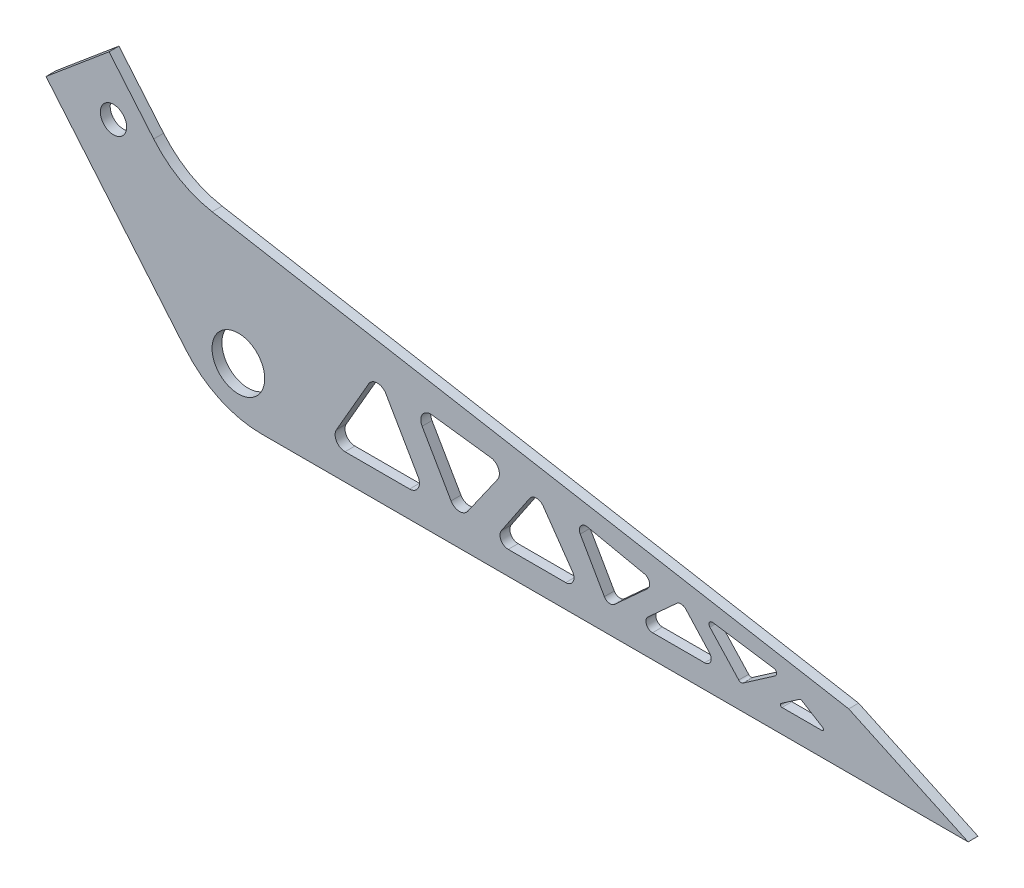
from build123d import *

# Parameters (mm, degrees)
SKETCH1_R           = 4
SKETCH1_R_2         = 8
BOSS_EXTRUDE1_DEPTH = 3


with BuildPart() as part:
    # Sketch1 → Boss-Extrude1 (new body)
    with BuildSketch(Plane.XY):
        with BuildLine():
            Line((0, 0), (19.151111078, 16.069690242))
            Line((19.151111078, 16.069690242), (32.701647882, -0.079210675))
            ThreePointArc((32.701647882, -0.079210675), (40.682981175, -6.776344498), (50.473535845, -10.339814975))
            Line((50.473535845, -10.339814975), (243.751551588, -44.419943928))
            Line((243.751551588, -44.419943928), (280.023008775, -61.28355545))
            Line((280.023008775, -61.28355545), (65.41223852, -61.28355545))
            ThreePointArc((65.41223852, -61.28355545), (52.733690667, -58.472789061), (42.430905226, -50.56718374))
            Line((42.430905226, -50.56718374), (0, 0))
        make_face()
        with Locations((20.489693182, -1.082808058)):
            Circle(SKETCH1_R, mode=Mode.SUBTRACT)
        with Locations((58.414162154, -46.279430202)):
            Circle(SKETCH1_R_2, mode=Mode.SUBTRACT)
        with BuildLine():
            Line((90.801355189, -53.28355545), (110.409050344, -53.28355545))
            ThreePointArc((110.409050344, -53.28355545), (113.007126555, -51.78355545), (113.007126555, -48.78355545))
            Line((113.007126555, -48.78355545), (103.203278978, -31.802793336))
            ThreePointArc((103.203278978, -31.802793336), (100.605202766, -30.302793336), (98.007126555, -31.802793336))
            Line((98.007126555, -31.802793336), (88.203278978, -48.78355545))
            ThreePointArc((88.203278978, -48.78355545), (88.203278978, -51.78355545), (90.801355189, -53.28355545))
        make_face(mode=Mode.SUBTRACT)
        with BuildLine():
            Line((114.216704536, -34.878605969), (123.006760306, -50.103429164))
            ThreePointArc((123.006760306, -50.103429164), (125.472993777, -51.600530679), (128.061161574, -50.325772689))
            Line((128.061161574, -50.325772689), (137.142966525, -37.373731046))
            ThreePointArc((137.142966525, -37.373731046), (137.430305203, -34.437999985), (135.065106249, -32.675355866))
            Line((135.065106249, -32.675355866), (117.193245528, -30.402574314))
            ThreePointArc((117.193245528, -30.402574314), (114.316704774, -31.717396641), (114.216704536, -34.878605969))
        make_face(mode=Mode.SUBTRACT)
        with BuildLine():
            Line((140.362734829, -54.178637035), (157.825672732, -54.178637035))
            ThreePointArc((157.825672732, -54.178637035), (160.041790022, -52.835712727), (159.87704509, -50.249696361))
            Line((159.87704509, -50.249696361), (150.992093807, -37.494552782))
            ThreePointArc((150.992093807, -37.494552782), (148.920237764, -36.423577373), (146.866209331, -37.528359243))
            Line((146.866209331, -37.528359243), (138.288222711, -50.283502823))
            ThreePointArc((138.288222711, -50.283502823), (138.156172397, -52.853831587), (140.362734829, -54.178637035))
        make_face(mode=Mode.SUBTRACT)
        with BuildLine():
            Line((162.227076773, -39.20828552), (169.563014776, -52.016086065))
            ThreePointArc((169.563014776, -52.016086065), (170.987532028, -52.99772966), (172.644718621, -52.501135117))
            Line((172.644718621, -52.501135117), (182.67432136, -43.372455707))
            ThreePointArc((182.67432136, -43.372455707), (183.258380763, -41.36991011), (181.742624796, -39.936802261))
            Line((181.742624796, -39.936802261), (164.377084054, -36.257681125))
            ThreePointArc((164.377084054, -36.257681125), (162.346158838, -37.036435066), (162.227076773, -39.20828552))
        make_face(mode=Mode.SUBTRACT)
        with BuildLine():
            Line((184.189376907, -54.178637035), (200.007119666, -54.178637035))
            ThreePointArc((200.007119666, -54.178637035), (201.836387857, -52.987202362), (201.486202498, -50.832414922))
            Line((201.486202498, -50.832414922), (194.319523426, -42.958445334))
            ThreePointArc((194.319523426, -42.958445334), (192.934387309, -42.306875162), (191.494218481, -42.825584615))
            Line((191.494218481, -42.825584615), (182.843154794, -50.699554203))
            ThreePointArc((182.843154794, -50.699554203), (182.324146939, -52.900382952), (184.189376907, -54.178637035))
        make_face(mode=Mode.SUBTRACT)
        with BuildLine():
            Line((210.371148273, -53.539300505), (201.593510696, -44.022631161))
            ThreePointArc((201.593510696, -44.022631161), (201.444662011, -42.877005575), (202.475506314, -42.355494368))
            Line((202.475506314, -42.355494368), (221.013850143, -45.109095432))
            ThreePointArc((221.013850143, -45.109095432), (221.840766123, -45.87100631), (221.436458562, -46.920212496))
            Line((221.436458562, -46.920212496), (211.67575231, -53.683280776))
            ThreePointArc((211.67575231, -53.683280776), (210.996523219, -53.855276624), (210.371148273, -53.539300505))
        make_face(mode=Mode.SUBTRACT)
        with BuildLine():
            Line((223.227204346, -53.267652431), (228.891360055, -49.343031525))
            ThreePointArc((228.891360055, -49.343031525), (229.161905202, -49.254218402), (229.437062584, -49.327504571))
            Line((229.437062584, -49.327504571), (235.852017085, -53.252125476))
            ThreePointArc((235.852017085, -53.252125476), (236.072357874, -53.814180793), (235.591080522, -54.178637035))
            Line((235.591080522, -54.178637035), (223.511970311, -54.178637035))
            ThreePointArc((223.511970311, -54.178637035), (223.034742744, -53.827814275), (223.227204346, -53.267652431))
        make_face(mode=Mode.SUBTRACT)
    extrude(amount=BOSS_EXTRUDE1_DEPTH)


solid = part.part
